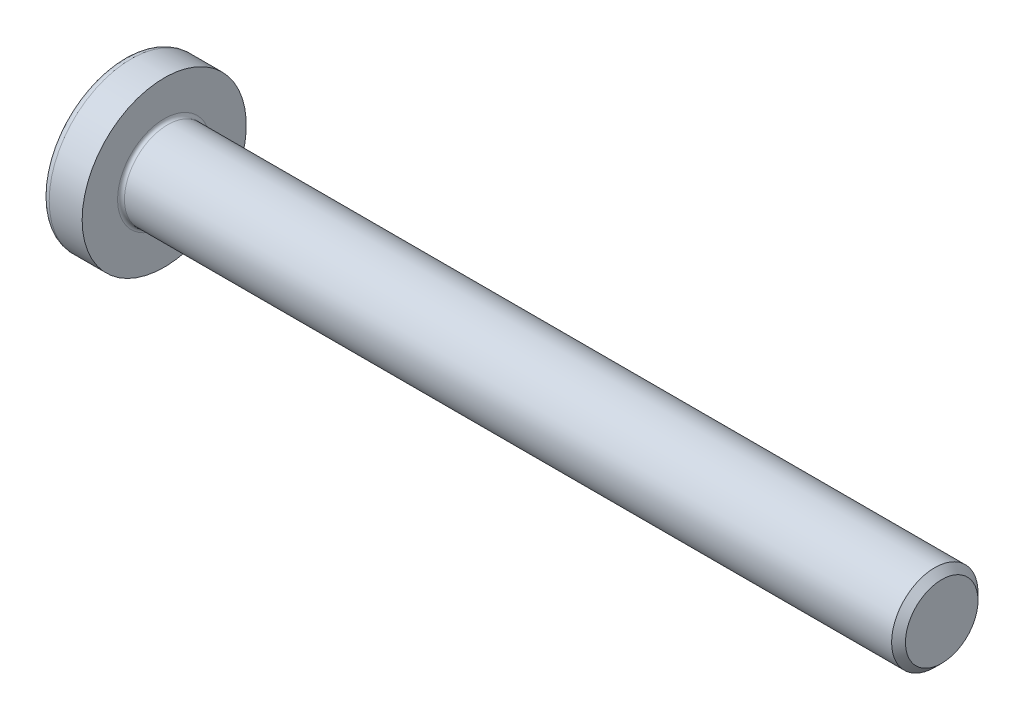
ISO-10303-21;
HEADER;
FILE_DESCRIPTION(('STEP AP214'),'2;1');
FILE_NAME('part.step','',(''),(''),'','','');
FILE_SCHEMA(('AUTOMOTIVE_DESIGN { 1 0 10303 214 1 1 1 1 }'));
ENDSEC;
DATA;
#1=APPLICATION_CONTEXT('core data for automotive mechanical design processes');
#2=APPLICATION_PROTOCOL_DEFINITION('international standard','automotive_design',2000,#1);
#3=PRODUCT_CONTEXT('',#1,'mechanical');
#4=PRODUCT('Part','Part','',(#3));
#5=PRODUCT_RELATED_PRODUCT_CATEGORY('part','',(#4));
#6=PRODUCT_DEFINITION_FORMATION('','',#4);
#7=PRODUCT_DEFINITION_CONTEXT('part definition',#1,'design');
#8=PRODUCT_DEFINITION('design','',#6,#7);
#9=PRODUCT_DEFINITION_SHAPE('','',#8);
#10=(LENGTH_UNIT() NAMED_UNIT(*) SI_UNIT(.MILLI.,.METRE.));
#11=(NAMED_UNIT(*) PLANE_ANGLE_UNIT() SI_UNIT($,.RADIAN.));
#12=(NAMED_UNIT(*) SI_UNIT($,.STERADIAN.) SOLID_ANGLE_UNIT());
#13=UNCERTAINTY_MEASURE_WITH_UNIT(LENGTH_MEASURE(1.E-05),#10,'distance_accuracy_value','');
#14=(GEOMETRIC_REPRESENTATION_CONTEXT(3) GLOBAL_UNCERTAINTY_ASSIGNED_CONTEXT((#13)) GLOBAL_UNIT_ASSIGNED_CONTEXT((#10,
#11,#12)) REPRESENTATION_CONTEXT('',''));
#15=CARTESIAN_POINT('',(0.,0.,0.));
#16=DIRECTION('',(0.,0.,1.));
#17=DIRECTION('',(1.,0.,0.));
#18=AXIS2_PLACEMENT_3D('',#15,#16,#17);
#19=CARTESIAN_POINT('',(8.,0.,0.));
#20=DIRECTION('',(-1.,0.,0.));
#21=DIRECTION('',(0.,1.,0.));
#22=AXIS2_PLACEMENT_3D('',#19,#20,#21);
#23=SPHERICAL_SURFACE('',#22,8.);
#24=CARTESIAN_POINT('',(1.42427123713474,0.,0.));
#25=DIRECTION('',(-1.,0.,0.));
#26=DIRECTION('',(0.,0.,1.));
#27=AXIS2_PLACEMENT_3D('',#24,#25,#26);
#28=CIRCLE('',#27,4.55629139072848);
#29=CARTESIAN_POINT('',(1.42427123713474,0.,4.55629139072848));
#30=VERTEX_POINT('',#29);
#31=EDGE_CURVE('E372',#30,#30,#28,.T.);
#32=ORIENTED_EDGE('',*,*,#31,.T.);
#33=EDGE_LOOP('',(#32));
#34=FACE_BOUND('',#33,.T.);
#35=CARTESIAN_POINT('',(0.0676093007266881,0.,0.));
#36=DIRECTION('',(1.,0.,0.));
#37=DIRECTION('',(0.,0.,-1.));
#38=AXIS2_PLACEMENT_3D('',#35,#36,#37);
#39=CIRCLE('',#38,1.03787176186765);
#40=CARTESIAN_POINT('',(0.067609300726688,-0.514999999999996,-0.901084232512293));
#41=VERTEX_POINT('',#40);
#42=CARTESIAN_POINT('',(0.0676093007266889,-0.901084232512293,-0.515));
#43=VERTEX_POINT('',#42);
#44=EDGE_CURVE('E415',#41,#43,#39,.F.);
#45=ORIENTED_EDGE('',*,*,#44,.F.);
#46=CARTESIAN_POINT('',(8.,-0.515,0.));
#47=DIRECTION('',(0.,1.,0.));
#48=DIRECTION('',(0.,0.,1.));
#49=AXIS2_PLACEMENT_3D('',#46,#47,#48);
#50=CIRCLE('',#49,7.98340622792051);
#51=CARTESIAN_POINT('',(0.322606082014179,-0.514999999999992,-2.18915454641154));
#52=VERTEX_POINT('',#51);
#53=EDGE_CURVE('E364',#52,#41,#50,.T.);
#54=ORIENTED_EDGE('',*,*,#53,.F.);
#55=CARTESIAN_POINT('',(7.34565688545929,0.,1.31240929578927));
#56=DIRECTION('',(0.446197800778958,0.,-0.89493436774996));
#57=DIRECTION('',(-0.89493436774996,0.,-0.446197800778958));
#58=AXIS2_PLACEMENT_3D('',#55,#56,#57);
#59=CIRCLE('',#58,7.86444002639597);
#60=CARTESIAN_POINT('',(0.322606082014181,0.515000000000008,-2.18915454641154));
#61=VERTEX_POINT('',#60);
#62=EDGE_CURVE('E238',#52,#61,#59,.T.);
#63=ORIENTED_EDGE('',*,*,#62,.T.);
#64=CARTESIAN_POINT('',(8.,0.515,0.));
#65=DIRECTION('',(0.,-1.,0.));
#66=DIRECTION('',(0.,0.,-1.));
#67=AXIS2_PLACEMENT_3D('',#64,#65,#66);
#68=CIRCLE('',#67,7.98340622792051);
#69=CARTESIAN_POINT('',(0.0676093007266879,0.515000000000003,-0.901084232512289));
#70=VERTEX_POINT('',#69);
#71=EDGE_CURVE('E368',#70,#61,#68,.T.);
#72=ORIENTED_EDGE('',*,*,#71,.F.);
#73=CARTESIAN_POINT('',(0.0676093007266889,0.901084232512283,-0.515));
#74=VERTEX_POINT('',#73);
#75=EDGE_CURVE('E439',#74,#70,#39,.F.);
#76=ORIENTED_EDGE('',*,*,#75,.F.);
#77=CARTESIAN_POINT('',(8.,0.,-0.515));
#78=DIRECTION('',(0.,0.,1.));
#79=DIRECTION('',(1.,0.,0.));
#80=AXIS2_PLACEMENT_3D('',#77,#78,#79);
#81=CIRCLE('',#80,7.98340622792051);
#82=CARTESIAN_POINT('',(0.32260608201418,2.18915454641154,-0.515));
#83=VERTEX_POINT('',#82);
#84=EDGE_CURVE('E232',#83,#74,#81,.T.);
#85=ORIENTED_EDGE('',*,*,#84,.F.);
#86=CARTESIAN_POINT('',(7.34565688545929,-1.31240929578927,0.));
#87=DIRECTION('',(0.446197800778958,0.89493436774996,0.));
#88=DIRECTION('',(-0.89493436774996,0.446197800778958,0.));
#89=AXIS2_PLACEMENT_3D('',#86,#87,#88);
#90=CIRCLE('',#89,7.86444002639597);
#91=CARTESIAN_POINT('',(0.322606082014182,2.18915454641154,0.514999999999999));
#92=VERTEX_POINT('',#91);
#93=EDGE_CURVE('E235',#83,#92,#90,.T.);
#94=ORIENTED_EDGE('',*,*,#93,.T.);
#95=CARTESIAN_POINT('',(8.,0.,0.515));
#96=DIRECTION('',(0.,0.,-1.));
#97=DIRECTION('',(0.,1.,0.));
#98=AXIS2_PLACEMENT_3D('',#95,#96,#97);
#99=CIRCLE('',#98,7.98340622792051);
#100=CARTESIAN_POINT('',(0.0676093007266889,0.901084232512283,0.515));
#101=VERTEX_POINT('',#100);
#102=EDGE_CURVE('E228',#101,#92,#99,.T.);
#103=ORIENTED_EDGE('',*,*,#102,.F.);
#104=CARTESIAN_POINT('',(0.067609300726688,0.514999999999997,0.901084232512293));
#105=VERTEX_POINT('',#104);
#106=EDGE_CURVE('E436',#105,#101,#39,.F.);
#107=ORIENTED_EDGE('',*,*,#106,.F.);
#108=CARTESIAN_POINT('',(0.322606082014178,0.514999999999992,2.18915454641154));
#109=VERTEX_POINT('',#108);
#110=EDGE_CURVE('E365',#109,#105,#68,.T.);
#111=ORIENTED_EDGE('',*,*,#110,.F.);
#112=CARTESIAN_POINT('',(7.34565688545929,0.,-1.31240929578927));
#113=DIRECTION('',(0.446197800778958,0.,0.89493436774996));
#114=DIRECTION('',(0.89493436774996,0.,-0.446197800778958));
#115=AXIS2_PLACEMENT_3D('',#112,#113,#114);
#116=CIRCLE('',#115,7.86444002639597);
#117=CARTESIAN_POINT('',(0.32260608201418,-0.515000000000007,2.18915454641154));
#118=VERTEX_POINT('',#117);
#119=EDGE_CURVE('E241',#109,#118,#116,.T.);
#120=ORIENTED_EDGE('',*,*,#119,.T.);
#121=CARTESIAN_POINT('',(0.0676093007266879,-0.515000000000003,0.901084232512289));
#122=VERTEX_POINT('',#121);
#123=EDGE_CURVE('E362',#122,#118,#50,.T.);
#124=ORIENTED_EDGE('',*,*,#123,.F.);
#125=CARTESIAN_POINT('',(0.0676093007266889,-0.901084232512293,0.514999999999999));
#126=VERTEX_POINT('',#125);
#127=EDGE_CURVE('E298',#126,#122,#39,.F.);
#128=ORIENTED_EDGE('',*,*,#127,.F.);
#129=CARTESIAN_POINT('',(0.322606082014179,-2.18915454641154,0.514999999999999));
#130=VERTEX_POINT('',#129);
#131=EDGE_CURVE('E229',#130,#126,#99,.T.);
#132=ORIENTED_EDGE('',*,*,#131,.F.);
#133=CARTESIAN_POINT('',(7.34565688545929,1.31240929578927,0.));
#134=DIRECTION('',(0.446197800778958,-0.89493436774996,0.));
#135=DIRECTION('',(0.89493436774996,0.446197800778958,0.));
#136=AXIS2_PLACEMENT_3D('',#133,#134,#135);
#137=CIRCLE('',#136,7.86444002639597);
#138=CARTESIAN_POINT('',(0.322606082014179,-2.18915454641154,-0.515));
#139=VERTEX_POINT('',#138);
#140=EDGE_CURVE('E219',#130,#139,#137,.T.);
#141=ORIENTED_EDGE('',*,*,#140,.T.);
#142=EDGE_CURVE('E58',#43,#139,#81,.T.);
#143=ORIENTED_EDGE('',*,*,#142,.F.);
#144=EDGE_LOOP('',(#45,#54,#63,#72,#76,#85,#94,#103,#107,#111,#120,#124,#128,#132,#141,#143));
#145=FACE_BOUND('',#144,.T.);
#146=ADVANCED_FACE('F35',(#34,#145),#23,.T.);
#147=CARTESIAN_POINT('',(0.,2.35,-0.515));
#148=DIRECTION('',(0.,0.,1.));
#149=DIRECTION('',(1.,0.,0.));
#150=AXIS2_PLACEMENT_3D('',#147,#148,#149);
#151=PLANE('',#150);
#152=ORIENTED_EDGE('',*,*,#84,.T.);
#153=CARTESIAN_POINT('',(-1.51390484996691,1.02651837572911,-0.515));
#154=CARTESIAN_POINT('',(-1.19828075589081,1.00181934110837,-0.515));
#155=CARTESIAN_POINT('',(-0.882669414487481,0.976954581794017,-0.515));
#156=CARTESIAN_POINT('',(-0.251463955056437,0.926774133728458,-0.515));
#157=CARTESIAN_POINT('',(0.0641301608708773,0.901458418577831,-0.515));
#158=CARTESIAN_POINT('',(0.537487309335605,0.863059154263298,-0.515));
#159=CARTESIAN_POINT('',(0.695267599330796,0.850188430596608,-0.515));
#160=CARTESIAN_POINT('',(1.01081295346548,0.824283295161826,-0.515));
#161=CARTESIAN_POINT('',(1.16857801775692,0.811248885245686,-0.515));
#162=CARTESIAN_POINT('',(1.48408237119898,0.784992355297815,-0.515));
#163=CARTESIAN_POINT('',(1.64182166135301,0.771770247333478,-0.515));
#164=CARTESIAN_POINT('',(1.95728793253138,0.7451057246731,-0.515));
#165=CARTESIAN_POINT('',(2.11501491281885,0.731663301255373,-0.515));
#166=CARTESIAN_POINT('',(2.48551875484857,0.699781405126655,-0.515));
#167=CARTESIAN_POINT('',(2.69828652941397,0.681236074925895,-0.515));
#168=CARTESIAN_POINT('',(3.12376344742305,0.643549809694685,-0.515));
#169=CARTESIAN_POINT('',(3.33647259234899,0.624408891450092,-0.515));
#170=CARTESIAN_POINT('',(3.76177021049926,0.585350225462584,-0.515));
#171=CARTESIAN_POINT('',(3.97435870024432,0.565432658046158,-0.515));
#172=CARTESIAN_POINT('',(4.39945864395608,0.524537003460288,-0.515));
#173=CARTESIAN_POINT('',(4.61197008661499,0.503558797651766,-0.515));
#174=CARTESIAN_POINT('',(4.93071637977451,0.470931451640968,-0.515));
#175=CARTESIAN_POINT('',(5.03701000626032,0.459857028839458,-0.515));
#176=CARTESIAN_POINT('',(5.24954252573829,0.437229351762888,-0.515));
#177=CARTESIAN_POINT('',(5.35578142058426,0.425676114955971,-0.515));
#178=CARTESIAN_POINT('',(5.56815317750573,0.401967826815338,-0.515));
#179=CARTESIAN_POINT('',(5.6742860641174,0.389812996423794,-0.515));
#180=CARTESIAN_POINT('',(5.88647145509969,0.364705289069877,-0.515));
#181=CARTESIAN_POINT('',(5.99252394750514,0.35175231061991,-0.515));
#182=CARTESIAN_POINT('',(6.20462993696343,0.324739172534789,-0.515));
#183=CARTESIAN_POINT('',(6.31068325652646,0.310677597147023,-0.515));
#184=CARTESIAN_POINT('',(6.46957142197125,0.288366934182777,-0.515));
#185=CARTESIAN_POINT('',(6.52249184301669,0.280728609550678,-0.515));
#186=CARTESIAN_POINT('',(6.62826069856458,0.2649303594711,-0.515));
#187=CARTESIAN_POINT('',(6.68110912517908,0.256770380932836,-0.515));
#188=CARTESIAN_POINT('',(6.78677752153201,0.239755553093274,-0.515));
#189=CARTESIAN_POINT('',(6.83959732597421,0.230899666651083,-0.515));
#190=CARTESIAN_POINT('',(6.94505554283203,0.212240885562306,-0.515));
#191=CARTESIAN_POINT('',(6.99769400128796,0.202438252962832,-0.515));
#192=CARTESIAN_POINT('',(7.10276751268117,0.181407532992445,-0.515));
#193=CARTESIAN_POINT('',(7.1552022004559,0.17017756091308,-0.515));
#194=CARTESIAN_POINT('',(7.23345080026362,0.151498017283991,-0.515));
#195=CARTESIAN_POINT('',(7.25947836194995,0.144962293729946,-0.515));
#196=CARTESIAN_POINT('',(7.31128722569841,0.130937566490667,-0.515));
#197=CARTESIAN_POINT('',(7.33706839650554,0.123448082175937,-0.515));
#198=CARTESIAN_POINT('',(7.36266137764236,0.115313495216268,-0.515));
#199=B_SPLINE_CURVE_WITH_KNOTS('',3,(#153,#154,#155,#156,#157,#158,#159,#160,#161,#162,#163,
#164,#165,#166,#167,#168,#169,#170,#171,#172,#173,#174,#175,#176,#177,#178,#179,#180,#181,#182,
#183,#184,#185,#186,#187,#188,#189,#190,#191,#192,#193,#194,#195,#196,#197,#198),.UNSPECIFIED.,
.F.,.F.,(4,2,2,2,2,2,2,2,2,2,2,2,2,2,2,2,2,2,2,2,2,2,4),(0.,0.949767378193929,1.89959054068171,
2.37450359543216,2.84941128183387,3.32428857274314,3.79918470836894,4.43990748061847,
5.08061221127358,5.72116905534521,6.36179770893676,6.68240380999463,7.0029982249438,
7.32347575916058,7.64399412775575,7.96492866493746,8.12533319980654,8.28575408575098,
8.44641876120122,8.60703909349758,8.76787376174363,8.84836551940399,8.92889800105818),.UNSPECIFIED.);
#200=CARTESIAN_POINT('',(2.74,0.677477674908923,-0.515));
#201=VERTEX_POINT('',#200);
#202=EDGE_CURVE('E276',#74,#201,#199,.T.);
#203=ORIENTED_EDGE('',*,*,#202,.T.);
#204=DIRECTION('',(0.,1.,0.));
#205=VECTOR('',#204,1.);
#206=CARTESIAN_POINT('',(2.74,-0.983886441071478,-0.515));
#207=LINE('',#206,#205);
#208=CARTESIAN_POINT('',(2.74,0.983886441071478,-0.515));
#209=VERTEX_POINT('',#208);
#210=EDGE_CURVE('E393',#201,#209,#207,.T.);
#211=ORIENTED_EDGE('',*,*,#210,.T.);
#212=DIRECTION('',(0.89493436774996,-0.446197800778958,0.));
#213=VECTOR('',#212,1.);
#214=CARTESIAN_POINT('',(0.,2.35,-0.515));
#215=LINE('',#214,#213);
#216=EDGE_CURVE('E369',#83,#209,#215,.T.);
#217=ORIENTED_EDGE('',*,*,#216,.F.);
#218=EDGE_LOOP('',(#152,#203,#211,#217));
#219=FACE_BOUND('',#218,.T.);
#220=ADVANCED_FACE('F167',(#219),#151,.T.);
#221=CARTESIAN_POINT('',(2.74,-0.983886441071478,-0.515));
#222=VERTEX_POINT('',#221);
#223=CARTESIAN_POINT('',(2.74,-0.677477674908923,-0.515));
#224=VERTEX_POINT('',#223);
#225=EDGE_CURVE('E390',#222,#224,#207,.T.);
#226=ORIENTED_EDGE('',*,*,#225,.T.);
#227=CARTESIAN_POINT('',(-1.51390484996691,-1.02651837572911,-0.515));
#228=CARTESIAN_POINT('',(-1.19828075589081,-1.00181934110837,-0.515));
#229=CARTESIAN_POINT('',(-0.882669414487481,-0.976954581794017,-0.515));
#230=CARTESIAN_POINT('',(-0.251463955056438,-0.926774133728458,-0.515));
#231=CARTESIAN_POINT('',(0.0641301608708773,-0.901458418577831,-0.515));
#232=CARTESIAN_POINT('',(0.537487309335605,-0.863059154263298,-0.515));
#233=CARTESIAN_POINT('',(0.695267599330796,-0.850188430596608,-0.515));
#234=CARTESIAN_POINT('',(1.01081295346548,-0.824283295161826,-0.515));
#235=CARTESIAN_POINT('',(1.16857801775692,-0.811248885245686,-0.515));
#236=CARTESIAN_POINT('',(1.48408237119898,-0.784992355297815,-0.515));
#237=CARTESIAN_POINT('',(1.64182166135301,-0.771770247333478,-0.515));
#238=CARTESIAN_POINT('',(1.95728793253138,-0.7451057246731,-0.515));
#239=CARTESIAN_POINT('',(2.11501491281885,-0.731663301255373,-0.515));
#240=CARTESIAN_POINT('',(2.48551875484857,-0.699781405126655,-0.515));
#241=CARTESIAN_POINT('',(2.69828652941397,-0.681236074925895,-0.515));
#242=CARTESIAN_POINT('',(3.12376344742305,-0.643549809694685,-0.515));
#243=CARTESIAN_POINT('',(3.33647259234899,-0.624408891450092,-0.515));
#244=CARTESIAN_POINT('',(3.76177021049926,-0.585350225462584,-0.515));
#245=CARTESIAN_POINT('',(3.97435870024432,-0.565432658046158,-0.515));
#246=CARTESIAN_POINT('',(4.39945864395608,-0.524537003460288,-0.515));
#247=CARTESIAN_POINT('',(4.61197008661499,-0.503558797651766,-0.515));
#248=CARTESIAN_POINT('',(4.93071637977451,-0.470931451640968,-0.515));
#249=CARTESIAN_POINT('',(5.03701000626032,-0.459857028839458,-0.515));
#250=CARTESIAN_POINT('',(5.24954252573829,-0.437229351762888,-0.515));
#251=CARTESIAN_POINT('',(5.35578142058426,-0.425676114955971,-0.515));
#252=CARTESIAN_POINT('',(5.56815317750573,-0.401967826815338,-0.515));
#253=CARTESIAN_POINT('',(5.6742860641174,-0.389812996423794,-0.515));
#254=CARTESIAN_POINT('',(5.88647145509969,-0.364705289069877,-0.515));
#255=CARTESIAN_POINT('',(5.99252394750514,-0.35175231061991,-0.515));
#256=CARTESIAN_POINT('',(6.20462993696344,-0.324739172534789,-0.515));
#257=CARTESIAN_POINT('',(6.31068325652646,-0.310677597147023,-0.515));
#258=CARTESIAN_POINT('',(6.46957142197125,-0.288366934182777,-0.515));
#259=CARTESIAN_POINT('',(6.52249184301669,-0.280728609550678,-0.515));
#260=CARTESIAN_POINT('',(6.62826069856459,-0.2649303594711,-0.515));
#261=CARTESIAN_POINT('',(6.68110912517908,-0.256770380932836,-0.515));
#262=CARTESIAN_POINT('',(6.78677752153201,-0.239755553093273,-0.515));
#263=CARTESIAN_POINT('',(6.83959732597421,-0.230899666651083,-0.515));
#264=CARTESIAN_POINT('',(6.94505554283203,-0.212240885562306,-0.515));
#265=CARTESIAN_POINT('',(6.99769400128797,-0.202438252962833,-0.515));
#266=CARTESIAN_POINT('',(7.10276751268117,-0.181407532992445,-0.515));
#267=CARTESIAN_POINT('',(7.1552022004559,-0.170177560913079,-0.515));
#268=CARTESIAN_POINT('',(7.23345080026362,-0.15149801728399,-0.515));
#269=CARTESIAN_POINT('',(7.25947836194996,-0.144962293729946,-0.515));
#270=CARTESIAN_POINT('',(7.31128722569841,-0.130937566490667,-0.515));
#271=CARTESIAN_POINT('',(7.33706839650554,-0.123448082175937,-0.515));
#272=CARTESIAN_POINT('',(7.36266137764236,-0.115313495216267,-0.515));
#273=B_SPLINE_CURVE_WITH_KNOTS('',3,(#227,#228,#229,#230,#231,#232,#233,#234,#235,#236,#237,
#238,#239,#240,#241,#242,#243,#244,#245,#246,#247,#248,#249,#250,#251,#252,#253,#254,#255,#256,
#257,#258,#259,#260,#261,#262,#263,#264,#265,#266,#267,#268,#269,#270,#271,#272),.UNSPECIFIED.,
.F.,.F.,(4,2,2,2,2,2,2,2,2,2,2,2,2,2,2,2,2,2,2,2,2,2,4),(0.,0.949767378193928,1.89959054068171,
2.37450359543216,2.84941128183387,3.32428857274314,3.79918470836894,4.43990748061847,
5.08061221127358,5.72116905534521,6.36179770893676,6.68240380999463,7.0029982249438,
7.32347575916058,7.64399412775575,7.96492866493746,8.12533319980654,8.28575408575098,
8.44641876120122,8.60703909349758,8.76787376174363,8.84836551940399,8.92889800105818),.UNSPECIFIED.);
#274=EDGE_CURVE('E263',#224,#43,#273,.F.);
#275=ORIENTED_EDGE('',*,*,#274,.T.);
#276=ORIENTED_EDGE('',*,*,#142,.T.);
#277=DIRECTION('',(0.89493436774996,0.446197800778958,0.));
#278=VECTOR('',#277,1.);
#279=CARTESIAN_POINT('',(0.,-2.35,-0.515));
#280=LINE('',#279,#278);
#281=EDGE_CURVE('E375',#139,#222,#280,.T.);
#282=ORIENTED_EDGE('',*,*,#281,.T.);
#283=EDGE_LOOP('',(#226,#275,#276,#282));
#284=FACE_BOUND('',#283,.T.);
#285=ADVANCED_FACE('F173',(#284),#151,.T.);
#286=CARTESIAN_POINT('',(0.,-2.35,0.514999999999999));
#287=DIRECTION('',(0.,0.,-1.));
#288=DIRECTION('',(0.,1.,0.));
#289=AXIS2_PLACEMENT_3D('',#286,#287,#288);
#290=PLANE('',#289);
#291=DIRECTION('',(0.,-1.,0.));
#292=VECTOR('',#291,1.);
#293=CARTESIAN_POINT('',(2.74,0.983886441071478,0.515));
#294=LINE('',#293,#292);
#295=CARTESIAN_POINT('',(2.74,0.983886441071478,0.515));
#296=VERTEX_POINT('',#295);
#297=CARTESIAN_POINT('',(2.74,0.677477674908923,0.515));
#298=VERTEX_POINT('',#297);
#299=EDGE_CURVE('E383',#296,#298,#294,.T.);
#300=ORIENTED_EDGE('',*,*,#299,.T.);
#301=CARTESIAN_POINT('',(-1.51390485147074,1.02651837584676,0.514999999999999));
#302=CARTESIAN_POINT('',(-1.19828075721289,1.00181934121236,0.514999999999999));
#303=CARTESIAN_POINT('',(-0.882669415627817,0.976954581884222,0.514999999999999));
#304=CARTESIAN_POINT('',(-0.251463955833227,0.926774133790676,0.515));
#305=CARTESIAN_POINT('',(0.0641301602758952,0.901458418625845,0.515));
#306=CARTESIAN_POINT('',(0.537487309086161,0.863059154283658,0.515));
#307=CARTESIAN_POINT('',(0.695267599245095,0.85018843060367,0.515));
#308=CARTESIAN_POINT('',(1.01081295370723,0.824283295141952,0.515));
#309=CARTESIAN_POINT('',(1.16857801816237,0.811248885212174,0.515));
#310=CARTESIAN_POINT('',(1.48408237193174,0.784992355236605,0.515));
#311=CARTESIAN_POINT('',(1.64182166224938,0.771770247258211,0.515));
#312=CARTESIAN_POINT('',(1.95728793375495,0.745105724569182,0.515));
#313=CARTESIAN_POINT('',(2.11501491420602,0.731663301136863,0.515));
#314=CARTESIAN_POINT('',(2.48551875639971,0.699781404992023,0.515));
#315=CARTESIAN_POINT('',(2.6982865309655,0.681236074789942,0.515));
#316=CARTESIAN_POINT('',(3.12376344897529,0.643549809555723,0.515));
#317=CARTESIAN_POINT('',(3.33647259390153,0.624408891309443,0.515));
#318=CARTESIAN_POINT('',(3.76177021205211,0.585350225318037,0.515));
#319=CARTESIAN_POINT('',(3.97435870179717,0.565432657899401,0.515));
#320=CARTESIAN_POINT('',(4.39945864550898,0.524537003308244,0.515));
#321=CARTESIAN_POINT('',(4.61197008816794,0.503558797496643,0.515));
#322=CARTESIAN_POINT('',(4.9307163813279,0.470931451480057,0.515));
#323=CARTESIAN_POINT('',(5.03701000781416,0.459857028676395,0.515));
#324=CARTESIAN_POINT('',(5.24954252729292,0.437229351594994,0.515));
#325=CARTESIAN_POINT('',(5.35578142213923,0.4256761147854,0.515));
#326=CARTESIAN_POINT('',(5.56815317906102,0.401967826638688,0.515));
#327=CARTESIAN_POINT('',(5.67428606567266,0.389812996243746,0.515));
#328=CARTESIAN_POINT('',(5.88647145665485,0.36470528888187,0.515));
#329=CARTESIAN_POINT('',(5.99252394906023,0.351752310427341,0.515));
#330=CARTESIAN_POINT('',(6.204629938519,0.324739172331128,0.515));
#331=CARTESIAN_POINT('',(6.31068325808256,0.31067759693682,0.515));
#332=CARTESIAN_POINT('',(6.46957142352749,0.288366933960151,0.515));
#333=CARTESIAN_POINT('',(6.52249184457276,0.280728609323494,0.515));
#334=CARTESIAN_POINT('',(6.62826070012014,0.26493035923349,0.515));
#335=CARTESIAN_POINT('',(6.68110912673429,0.256770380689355,0.515));
#336=CARTESIAN_POINT('',(6.7867775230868,0.239755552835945,0.515));
#337=CARTESIAN_POINT('',(6.83959732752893,0.230899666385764,0.515));
#338=CARTESIAN_POINT('',(6.94505554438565,0.212240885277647,0.515));
#339=CARTESIAN_POINT('',(6.99769400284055,0.202438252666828,0.515));
#340=CARTESIAN_POINT('',(7.10276751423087,0.181407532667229,0.515));
#341=CARTESIAN_POINT('',(7.15520220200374,0.170177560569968,0.515));
#342=CARTESIAN_POINT('',(7.23345080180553,0.151498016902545,0.515));
#343=CARTESIAN_POINT('',(7.25947836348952,0.144962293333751,0.515));
#344=CARTESIAN_POINT('',(7.31128722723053,0.130937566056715,0.515));
#345=CARTESIAN_POINT('',(7.33706839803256,0.123448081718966,0.515));
#346=CARTESIAN_POINT('',(7.36266137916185,0.115313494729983,0.515));
#347=B_SPLINE_CURVE_WITH_KNOTS('',3,(#301,#302,#303,#304,#305,#306,#307,#308,#309,#310,#311,
#312,#313,#314,#315,#316,#317,#318,#319,#320,#321,#322,#323,#324,#325,#326,#327,#328,#329,#330,
#331,#332,#333,#334,#335,#336,#337,#338,#339,#340,#341,#342,#343,#344,#345,#346),.UNSPECIFIED.,
.F.,.F.,(4,2,2,2,2,2,2,2,2,2,2,2,2,2,2,2,2,2,2,2,2,2,4),(0.,0.949767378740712,1.89959054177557,
2.37450359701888,2.8494112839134,3.32428857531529,3.79918471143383,4.43990748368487,
5.08061221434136,5.7211690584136,6.36179771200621,6.68240381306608,7.00299822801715,
7.32347576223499,7.6439941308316,7.96492866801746,8.12533320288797,8.28575408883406,
8.44641876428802,8.6070390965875,8.76787376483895,8.84836552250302,8.92889800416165),.UNSPECIFIED.);
#348=EDGE_CURVE('E287',#298,#101,#347,.F.);
#349=ORIENTED_EDGE('',*,*,#348,.T.);
#350=ORIENTED_EDGE('',*,*,#102,.T.);
#351=DIRECTION('',(0.89493436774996,-0.446197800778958,0.));
#352=VECTOR('',#351,1.);
#353=CARTESIAN_POINT('',(0.,2.35,0.515));
#354=LINE('',#353,#352);
#355=EDGE_CURVE('E373',#92,#296,#354,.T.);
#356=ORIENTED_EDGE('',*,*,#355,.T.);
#357=EDGE_LOOP('',(#300,#349,#350,#356));
#358=FACE_BOUND('',#357,.T.);
#359=ADVANCED_FACE('F308',(#358),#290,.T.);
#360=ORIENTED_EDGE('',*,*,#131,.T.);
#361=CARTESIAN_POINT('',(-1.51390485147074,-1.02651837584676,0.514999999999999));
#362=CARTESIAN_POINT('',(-1.19828075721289,-1.00181934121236,0.514999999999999));
#363=CARTESIAN_POINT('',(-0.882669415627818,-0.976954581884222,0.514999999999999));
#364=CARTESIAN_POINT('',(-0.251463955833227,-0.926774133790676,0.514999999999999));
#365=CARTESIAN_POINT('',(0.0641301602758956,-0.901458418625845,0.514999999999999));
#366=CARTESIAN_POINT('',(0.537487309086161,-0.863059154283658,0.514999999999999));
#367=CARTESIAN_POINT('',(0.695267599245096,-0.850188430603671,0.514999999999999));
#368=CARTESIAN_POINT('',(1.01081295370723,-0.824283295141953,0.514999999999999));
#369=CARTESIAN_POINT('',(1.16857801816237,-0.811248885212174,0.514999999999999));
#370=CARTESIAN_POINT('',(1.48408237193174,-0.784992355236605,0.514999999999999));
#371=CARTESIAN_POINT('',(1.64182166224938,-0.771770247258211,0.514999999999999));
#372=CARTESIAN_POINT('',(1.95728793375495,-0.745105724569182,0.514999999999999));
#373=CARTESIAN_POINT('',(2.11501491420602,-0.731663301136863,0.515));
#374=CARTESIAN_POINT('',(2.48551875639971,-0.699781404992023,0.515));
#375=CARTESIAN_POINT('',(2.6982865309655,-0.681236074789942,0.515));
#376=CARTESIAN_POINT('',(3.12376344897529,-0.643549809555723,0.515));
#377=CARTESIAN_POINT('',(3.33647259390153,-0.624408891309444,0.515));
#378=CARTESIAN_POINT('',(3.76177021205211,-0.585350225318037,0.515));
#379=CARTESIAN_POINT('',(3.97435870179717,-0.565432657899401,0.515));
#380=CARTESIAN_POINT('',(4.39945864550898,-0.524537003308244,0.515));
#381=CARTESIAN_POINT('',(4.61197008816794,-0.503558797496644,0.515));
#382=CARTESIAN_POINT('',(4.9307163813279,-0.470931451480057,0.515));
#383=CARTESIAN_POINT('',(5.03701000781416,-0.459857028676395,0.515));
#384=CARTESIAN_POINT('',(5.24954252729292,-0.437229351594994,0.515));
#385=CARTESIAN_POINT('',(5.35578142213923,-0.4256761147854,0.515));
#386=CARTESIAN_POINT('',(5.56815317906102,-0.401967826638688,0.515));
#387=CARTESIAN_POINT('',(5.67428606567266,-0.389812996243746,0.515));
#388=CARTESIAN_POINT('',(5.88647145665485,-0.36470528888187,0.515));
#389=CARTESIAN_POINT('',(5.99252394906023,-0.351752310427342,0.515));
#390=CARTESIAN_POINT('',(6.20462993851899,-0.324739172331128,0.515));
#391=CARTESIAN_POINT('',(6.31068325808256,-0.31067759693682,0.515));
#392=CARTESIAN_POINT('',(6.46957142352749,-0.288366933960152,0.515));
#393=CARTESIAN_POINT('',(6.52249184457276,-0.280728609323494,0.515));
#394=CARTESIAN_POINT('',(6.62826070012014,-0.264930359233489,0.515));
#395=CARTESIAN_POINT('',(6.68110912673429,-0.256770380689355,0.515));
#396=CARTESIAN_POINT('',(6.7867775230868,-0.239755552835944,0.515));
#397=CARTESIAN_POINT('',(6.83959732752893,-0.230899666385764,0.515));
#398=CARTESIAN_POINT('',(6.94505554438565,-0.212240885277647,0.515));
#399=CARTESIAN_POINT('',(6.99769400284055,-0.202438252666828,0.515));
#400=CARTESIAN_POINT('',(7.10276751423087,-0.181407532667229,0.515));
#401=CARTESIAN_POINT('',(7.15520220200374,-0.170177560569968,0.515));
#402=CARTESIAN_POINT('',(7.23345080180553,-0.151498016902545,0.515));
#403=CARTESIAN_POINT('',(7.25947836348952,-0.144962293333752,0.515));
#404=CARTESIAN_POINT('',(7.31128722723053,-0.130937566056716,0.515));
#405=CARTESIAN_POINT('',(7.33706839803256,-0.123448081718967,0.515));
#406=CARTESIAN_POINT('',(7.36266137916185,-0.115313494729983,0.515));
#407=B_SPLINE_CURVE_WITH_KNOTS('',3,(#361,#362,#363,#364,#365,#366,#367,#368,#369,#370,#371,
#372,#373,#374,#375,#376,#377,#378,#379,#380,#381,#382,#383,#384,#385,#386,#387,#388,#389,#390,
#391,#392,#393,#394,#395,#396,#397,#398,#399,#400,#401,#402,#403,#404,#405,#406),.UNSPECIFIED.,
.F.,.F.,(4,2,2,2,2,2,2,2,2,2,2,2,2,2,2,2,2,2,2,2,2,2,4),(0.,0.949767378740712,1.89959054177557,
2.37450359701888,2.8494112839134,3.32428857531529,3.79918471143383,4.43990748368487,
5.08061221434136,5.7211690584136,6.36179771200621,6.68240381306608,7.00299822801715,
7.32347576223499,7.6439941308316,7.96492866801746,8.12533320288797,8.28575408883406,
8.44641876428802,8.6070390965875,8.76787376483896,8.84836552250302,8.92889800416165),.UNSPECIFIED.);
#408=CARTESIAN_POINT('',(2.74,-0.677477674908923,0.515));
#409=VERTEX_POINT('',#408);
#410=EDGE_CURVE('E299',#126,#409,#407,.T.);
#411=ORIENTED_EDGE('',*,*,#410,.T.);
#412=CARTESIAN_POINT('',(2.74,-0.983886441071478,0.515));
#413=VERTEX_POINT('',#412);
#414=EDGE_CURVE('E386',#409,#413,#294,.T.);
#415=ORIENTED_EDGE('',*,*,#414,.T.);
#416=DIRECTION('',(0.89493436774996,0.446197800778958,0.));
#417=VECTOR('',#416,1.);
#418=CARTESIAN_POINT('',(0.,-2.35,0.514999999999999));
#419=LINE('',#418,#417);
#420=EDGE_CURVE('E377',#130,#413,#419,.T.);
#421=ORIENTED_EDGE('',*,*,#420,.F.);
#422=EDGE_LOOP('',(#360,#411,#415,#421));
#423=FACE_BOUND('',#422,.T.);
#424=ADVANCED_FACE('F312',(#423),#290,.T.);
#425=CARTESIAN_POINT('',(2.74,-0.983886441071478,-0.515));
#426=DIRECTION('',(1.,0.,0.));
#427=DIRECTION('',(0.,0.,-1.));
#428=AXIS2_PLACEMENT_3D('',#425,#426,#427);
#429=PLANE('',#428);
#430=CARTESIAN_POINT('',(2.74,0.,0.));
#431=DIRECTION('',(-1.,0.,0.));
#432=DIRECTION('',(0.,0.,1.));
#433=AXIS2_PLACEMENT_3D('',#430,#431,#432);
#434=CIRCLE('',#433,0.851);
#435=EDGE_CURVE('E449',#224,#409,#434,.T.);
#436=ORIENTED_EDGE('',*,*,#435,.F.);
#437=ORIENTED_EDGE('',*,*,#225,.F.);
#438=DIRECTION('',(0.,0.,1.));
#439=VECTOR('',#438,1.);
#440=CARTESIAN_POINT('',(2.74,-0.983886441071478,-0.515));
#441=LINE('',#440,#439);
#442=EDGE_CURVE('E380',#222,#413,#441,.T.);
#443=ORIENTED_EDGE('',*,*,#442,.T.);
#444=ORIENTED_EDGE('',*,*,#414,.F.);
#445=EDGE_LOOP('',(#436,#437,#443,#444));
#446=FACE_BOUND('',#445,.T.);
#447=ADVANCED_FACE('F318',(#446),#429,.F.);
#448=CARTESIAN_POINT('',(2.74,-0.515000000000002,0.677477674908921));
#449=VERTEX_POINT('',#448);
#450=CARTESIAN_POINT('',(2.74,0.514999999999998,0.677477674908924));
#451=VERTEX_POINT('',#450);
#452=EDGE_CURVE('E427',#449,#451,#434,.T.);
#453=ORIENTED_EDGE('',*,*,#452,.F.);
#454=DIRECTION('',(0.,0.,-1.));
#455=VECTOR('',#454,1.);
#456=CARTESIAN_POINT('',(2.74,-0.515000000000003,0.983886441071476));
#457=LINE('',#456,#455);
#458=CARTESIAN_POINT('',(2.74,-0.515000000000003,0.983886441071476));
#459=VERTEX_POINT('',#458);
#460=EDGE_CURVE('E418',#459,#449,#457,.T.);
#461=ORIENTED_EDGE('',*,*,#460,.F.);
#462=DIRECTION('',(0.,1.,0.));
#463=VECTOR('',#462,1.);
#464=CARTESIAN_POINT('',(2.74,-0.515000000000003,0.983886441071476));
#465=LINE('',#464,#463);
#466=CARTESIAN_POINT('',(2.74,0.514999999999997,0.98388644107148));
#467=VERTEX_POINT('',#466);
#468=EDGE_CURVE('E356',#459,#467,#465,.T.);
#469=ORIENTED_EDGE('',*,*,#468,.T.);
#470=DIRECTION('',(0.,0.,1.));
#471=VECTOR('',#470,1.);
#472=CARTESIAN_POINT('',(2.74,0.515000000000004,-0.983886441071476));
#473=LINE('',#472,#471);
#474=EDGE_CURVE('E305',#451,#467,#473,.T.);
#475=ORIENTED_EDGE('',*,*,#474,.F.);
#476=EDGE_LOOP('',(#453,#461,#469,#475));
#477=FACE_BOUND('',#476,.T.);
#478=ADVANCED_FACE('F320',(#477),#429,.F.);
#479=EDGE_CURVE('E443',#298,#201,#434,.T.);
#480=ORIENTED_EDGE('',*,*,#479,.F.);
#481=ORIENTED_EDGE('',*,*,#299,.F.);
#482=DIRECTION('',(0.,0.,-1.));
#483=VECTOR('',#482,1.);
#484=CARTESIAN_POINT('',(2.74,0.983886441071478,0.515));
#485=LINE('',#484,#483);
#486=EDGE_CURVE('E387',#296,#209,#485,.T.);
#487=ORIENTED_EDGE('',*,*,#486,.T.);
#488=ORIENTED_EDGE('',*,*,#210,.F.);
#489=EDGE_LOOP('',(#480,#481,#487,#488));
#490=FACE_BOUND('',#489,.T.);
#491=ADVANCED_FACE('F327',(#490),#429,.F.);
#492=CARTESIAN_POINT('',(2.74,0.515000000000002,-0.677477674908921));
#493=VERTEX_POINT('',#492);
#494=CARTESIAN_POINT('',(2.74,-0.514999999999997,-0.677477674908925));
#495=VERTEX_POINT('',#494);
#496=EDGE_CURVE('E50',#493,#495,#434,.T.);
#497=ORIENTED_EDGE('',*,*,#496,.F.);
#498=CARTESIAN_POINT('',(2.74,0.515000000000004,-0.983886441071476));
#499=VERTEX_POINT('',#498);
#500=EDGE_CURVE('E344',#499,#493,#473,.T.);
#501=ORIENTED_EDGE('',*,*,#500,.F.);
#502=DIRECTION('',(0.,-1.,0.));
#503=VECTOR('',#502,1.);
#504=CARTESIAN_POINT('',(2.74,0.515000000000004,-0.983886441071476));
#505=LINE('',#504,#503);
#506=CARTESIAN_POINT('',(2.74,-0.514999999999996,-0.983886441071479));
#507=VERTEX_POINT('',#506);
#508=EDGE_CURVE('E408',#499,#507,#505,.T.);
#509=ORIENTED_EDGE('',*,*,#508,.T.);
#510=EDGE_CURVE('E345',#495,#507,#457,.T.);
#511=ORIENTED_EDGE('',*,*,#510,.F.);
#512=EDGE_LOOP('',(#497,#501,#509,#511));
#513=FACE_BOUND('',#512,.T.);
#514=ADVANCED_FACE('F322',(#513),#429,.F.);
#515=CARTESIAN_POINT('',(0.,-0.514999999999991,-2.35));
#516=DIRECTION('',(0.,1.,0.));
#517=DIRECTION('',(0.,0.,1.));
#518=AXIS2_PLACEMENT_3D('',#515,#516,#517);
#519=PLANE('',#518);
#520=ORIENTED_EDGE('',*,*,#460,.T.);
#521=CARTESIAN_POINT('',(-1.51390485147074,-0.515000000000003,1.02651837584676));
#522=CARTESIAN_POINT('',(-1.19828075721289,-0.515000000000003,1.00181934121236));
#523=CARTESIAN_POINT('',(-0.882669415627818,-0.515000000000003,0.97695458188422));
#524=CARTESIAN_POINT('',(-0.251463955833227,-0.515000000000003,0.926774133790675));
#525=CARTESIAN_POINT('',(0.0641301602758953,-0.515000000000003,0.901458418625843));
#526=CARTESIAN_POINT('',(0.537487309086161,-0.515000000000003,0.863059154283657));
#527=CARTESIAN_POINT('',(0.695267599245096,-0.515000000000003,0.850188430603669));
#528=CARTESIAN_POINT('',(1.01081295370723,-0.515000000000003,0.824283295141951));
#529=CARTESIAN_POINT('',(1.16857801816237,-0.515000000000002,0.811248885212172));
#530=CARTESIAN_POINT('',(1.48408237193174,-0.515000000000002,0.784992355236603));
#531=CARTESIAN_POINT('',(1.64182166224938,-0.515000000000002,0.771770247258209));
#532=CARTESIAN_POINT('',(1.95728793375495,-0.515000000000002,0.74510572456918));
#533=CARTESIAN_POINT('',(2.11501491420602,-0.515000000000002,0.731663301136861));
#534=CARTESIAN_POINT('',(2.48551875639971,-0.515000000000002,0.699781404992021));
#535=CARTESIAN_POINT('',(2.6982865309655,-0.515000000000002,0.68123607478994));
#536=CARTESIAN_POINT('',(3.12376344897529,-0.515000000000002,0.643549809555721));
#537=CARTESIAN_POINT('',(3.33647259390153,-0.515000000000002,0.624408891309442));
#538=CARTESIAN_POINT('',(3.76177021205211,-0.515000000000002,0.585350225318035));
#539=CARTESIAN_POINT('',(3.97435870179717,-0.515000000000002,0.565432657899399));
#540=CARTESIAN_POINT('',(4.39945864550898,-0.515000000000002,0.524537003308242));
#541=CARTESIAN_POINT('',(4.61197008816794,-0.515000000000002,0.503558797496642));
#542=CARTESIAN_POINT('',(4.93071638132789,-0.515000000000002,0.470931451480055));
#543=CARTESIAN_POINT('',(5.03701000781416,-0.515000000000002,0.459857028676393));
#544=CARTESIAN_POINT('',(5.24954252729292,-0.515000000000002,0.437229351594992));
#545=CARTESIAN_POINT('',(5.35578142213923,-0.515000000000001,0.425676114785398));
#546=CARTESIAN_POINT('',(5.56815317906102,-0.515000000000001,0.401967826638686));
#547=CARTESIAN_POINT('',(5.67428606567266,-0.515000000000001,0.389812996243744));
#548=CARTESIAN_POINT('',(5.88647145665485,-0.515000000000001,0.364705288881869));
#549=CARTESIAN_POINT('',(5.99252394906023,-0.515000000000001,0.35175231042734));
#550=CARTESIAN_POINT('',(6.20462993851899,-0.515000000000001,0.324739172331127));
#551=CARTESIAN_POINT('',(6.31068325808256,-0.515000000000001,0.310677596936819));
#552=CARTESIAN_POINT('',(6.46957142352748,-0.515000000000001,0.28836693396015));
#553=CARTESIAN_POINT('',(6.52249184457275,-0.515000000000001,0.280728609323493));
#554=CARTESIAN_POINT('',(6.62826070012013,-0.515000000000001,0.264930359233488));
#555=CARTESIAN_POINT('',(6.68110912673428,-0.515000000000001,0.256770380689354));
#556=CARTESIAN_POINT('',(6.7867775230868,-0.515000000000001,0.239755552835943));
#557=CARTESIAN_POINT('',(6.83959732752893,-0.515000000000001,0.230899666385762));
#558=CARTESIAN_POINT('',(6.94505554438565,-0.515000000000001,0.212240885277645));
#559=CARTESIAN_POINT('',(6.99769400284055,-0.515000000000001,0.202438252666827));
#560=CARTESIAN_POINT('',(7.10276751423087,-0.515000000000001,0.181407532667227));
#561=CARTESIAN_POINT('',(7.15520220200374,-0.515000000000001,0.170177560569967));
#562=CARTESIAN_POINT('',(7.23345080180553,-0.515000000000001,0.151498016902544));
#563=CARTESIAN_POINT('',(7.25947836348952,-0.515000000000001,0.14496229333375));
#564=CARTESIAN_POINT('',(7.31128722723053,-0.515000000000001,0.130937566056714));
#565=CARTESIAN_POINT('',(7.33706839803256,-0.515000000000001,0.123448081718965));
#566=CARTESIAN_POINT('',(7.36266137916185,-0.515000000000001,0.115313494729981));
#567=B_SPLINE_CURVE_WITH_KNOTS('',3,(#521,#522,#523,#524,#525,#526,#527,#528,#529,#530,#531,
#532,#533,#534,#535,#536,#537,#538,#539,#540,#541,#542,#543,#544,#545,#546,#547,#548,#549,#550,
#551,#552,#553,#554,#555,#556,#557,#558,#559,#560,#561,#562,#563,#564,#565,#566),.UNSPECIFIED.,
.F.,.F.,(4,2,2,2,2,2,2,2,2,2,2,2,2,2,2,2,2,2,2,2,2,2,4),(0.,0.949767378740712,1.89959054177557,
2.37450359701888,2.8494112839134,3.32428857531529,3.79918471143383,4.43990748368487,
5.08061221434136,5.72116905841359,6.36179771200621,6.68240381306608,7.00299822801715,
7.32347576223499,7.6439941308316,7.96492866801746,8.12533320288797,8.28575408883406,
8.44641876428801,8.6070390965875,8.76787376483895,8.84836552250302,8.92889800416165),.UNSPECIFIED.);
#568=EDGE_CURVE('E293',#449,#122,#567,.F.);
#569=ORIENTED_EDGE('',*,*,#568,.T.);
#570=ORIENTED_EDGE('',*,*,#123,.T.);
#571=DIRECTION('',(0.89493436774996,0.,-0.446197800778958));
#572=VECTOR('',#571,1.);
#573=CARTESIAN_POINT('',(0.,-0.515000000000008,2.35));
#574=LINE('',#573,#572);
#575=EDGE_CURVE('E409',#118,#459,#574,.T.);
#576=ORIENTED_EDGE('',*,*,#575,.T.);
#577=EDGE_LOOP('',(#520,#569,#570,#576));
#578=FACE_BOUND('',#577,.T.);
#579=ADVANCED_FACE('F250',(#578),#519,.T.);
#580=CARTESIAN_POINT('',(0.,0.514999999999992,2.35));
#581=DIRECTION('',(0.,-1.,0.));
#582=DIRECTION('',(1.,0.,0.));
#583=AXIS2_PLACEMENT_3D('',#580,#581,#582);
#584=PLANE('',#583);
#585=ORIENTED_EDGE('',*,*,#110,.T.);
#586=CARTESIAN_POINT('',(-1.51390484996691,0.514999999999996,1.02651837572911));
#587=CARTESIAN_POINT('',(-1.19828075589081,0.514999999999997,1.00181934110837));
#588=CARTESIAN_POINT('',(-0.882669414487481,0.514999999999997,0.976954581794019));
#589=CARTESIAN_POINT('',(-0.251463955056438,0.514999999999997,0.92677413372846));
#590=CARTESIAN_POINT('',(0.0641301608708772,0.514999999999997,0.901458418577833));
#591=CARTESIAN_POINT('',(0.537487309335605,0.514999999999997,0.8630591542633));
#592=CARTESIAN_POINT('',(0.695267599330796,0.514999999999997,0.850188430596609));
#593=CARTESIAN_POINT('',(1.01081295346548,0.514999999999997,0.824283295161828));
#594=CARTESIAN_POINT('',(1.16857801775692,0.514999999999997,0.811248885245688));
#595=CARTESIAN_POINT('',(1.48408237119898,0.514999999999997,0.784992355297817));
#596=CARTESIAN_POINT('',(1.64182166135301,0.514999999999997,0.77177024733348));
#597=CARTESIAN_POINT('',(1.95728793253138,0.514999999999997,0.745105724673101));
#598=CARTESIAN_POINT('',(2.11501491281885,0.514999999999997,0.731663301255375));
#599=CARTESIAN_POINT('',(2.48551875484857,0.514999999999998,0.699781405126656));
#600=CARTESIAN_POINT('',(2.69828652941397,0.514999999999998,0.681236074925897));
#601=CARTESIAN_POINT('',(3.12376344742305,0.514999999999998,0.643549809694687));
#602=CARTESIAN_POINT('',(3.33647259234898,0.514999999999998,0.624408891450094));
#603=CARTESIAN_POINT('',(3.76177021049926,0.514999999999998,0.585350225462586));
#604=CARTESIAN_POINT('',(3.97435870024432,0.514999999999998,0.56543265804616));
#605=CARTESIAN_POINT('',(4.39945864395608,0.514999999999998,0.524537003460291));
#606=CARTESIAN_POINT('',(4.61197008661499,0.514999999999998,0.503558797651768));
#607=CARTESIAN_POINT('',(4.93071637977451,0.514999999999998,0.47093145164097));
#608=CARTESIAN_POINT('',(5.03701000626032,0.514999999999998,0.459857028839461));
#609=CARTESIAN_POINT('',(5.24954252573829,0.514999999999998,0.43722935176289));
#610=CARTESIAN_POINT('',(5.35578142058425,0.514999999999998,0.425676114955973));
#611=CARTESIAN_POINT('',(5.56815317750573,0.514999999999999,0.40196782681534));
#612=CARTESIAN_POINT('',(5.6742860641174,0.514999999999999,0.389812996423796));
#613=CARTESIAN_POINT('',(5.88647145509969,0.514999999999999,0.364705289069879));
#614=CARTESIAN_POINT('',(5.99252394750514,0.514999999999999,0.351752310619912));
#615=CARTESIAN_POINT('',(6.20462993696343,0.514999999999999,0.324739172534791));
#616=CARTESIAN_POINT('',(6.31068325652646,0.514999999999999,0.310677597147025));
#617=CARTESIAN_POINT('',(6.46957142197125,0.514999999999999,0.288366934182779));
#618=CARTESIAN_POINT('',(6.52249184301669,0.514999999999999,0.28072860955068));
#619=CARTESIAN_POINT('',(6.62826069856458,0.514999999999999,0.264930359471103));
#620=CARTESIAN_POINT('',(6.68110912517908,0.514999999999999,0.256770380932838));
#621=CARTESIAN_POINT('',(6.78677752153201,0.514999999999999,0.239755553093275));
#622=CARTESIAN_POINT('',(6.83959732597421,0.514999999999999,0.230899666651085));
#623=CARTESIAN_POINT('',(6.94505554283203,0.514999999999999,0.212240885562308));
#624=CARTESIAN_POINT('',(6.99769400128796,0.514999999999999,0.202438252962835));
#625=CARTESIAN_POINT('',(7.10276751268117,0.514999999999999,0.181407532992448));
#626=CARTESIAN_POINT('',(7.1552022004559,0.514999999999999,0.170177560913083));
#627=CARTESIAN_POINT('',(7.23345080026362,0.514999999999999,0.151498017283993));
#628=CARTESIAN_POINT('',(7.25947836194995,0.514999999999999,0.144962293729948));
#629=CARTESIAN_POINT('',(7.31128722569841,0.514999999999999,0.130937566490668));
#630=CARTESIAN_POINT('',(7.33706839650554,0.514999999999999,0.123448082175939));
#631=CARTESIAN_POINT('',(7.36266137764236,0.515,0.115313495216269));
#632=B_SPLINE_CURVE_WITH_KNOTS('',3,(#586,#587,#588,#589,#590,#591,#592,#593,#594,#595,#596,
#597,#598,#599,#600,#601,#602,#603,#604,#605,#606,#607,#608,#609,#610,#611,#612,#613,#614,#615,
#616,#617,#618,#619,#620,#621,#622,#623,#624,#625,#626,#627,#628,#629,#630,#631),.UNSPECIFIED.,
.F.,.F.,(4,2,2,2,2,2,2,2,2,2,2,2,2,2,2,2,2,2,2,2,2,2,4),(0.,0.949767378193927,1.89959054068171,
2.37450359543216,2.84941128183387,3.32428857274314,3.79918470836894,4.43990748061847,
5.08061221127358,5.72116905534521,6.36179770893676,6.68240380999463,7.0029982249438,
7.32347575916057,7.64399412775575,7.96492866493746,8.12533319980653,8.28575408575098,
8.44641876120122,8.60703909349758,8.76787376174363,8.84836551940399,8.92889800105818),.UNSPECIFIED.);
#633=EDGE_CURVE('E282',#105,#451,#632,.T.);
#634=ORIENTED_EDGE('',*,*,#633,.T.);
#635=ORIENTED_EDGE('',*,*,#474,.T.);
#636=DIRECTION('',(0.89493436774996,0.,-0.446197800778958));
#637=VECTOR('',#636,1.);
#638=CARTESIAN_POINT('',(0.,0.514999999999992,2.35));
#639=LINE('',#638,#637);
#640=EDGE_CURVE('E306',#109,#467,#639,.T.);
#641=ORIENTED_EDGE('',*,*,#640,.F.);
#642=EDGE_LOOP('',(#585,#634,#635,#641));
#643=FACE_BOUND('',#642,.T.);
#644=ADVANCED_FACE('F337',(#643),#584,.T.);
#645=ORIENTED_EDGE('',*,*,#500,.T.);
#646=CARTESIAN_POINT('',(-1.51390485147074,0.515000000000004,-1.02651837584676));
#647=CARTESIAN_POINT('',(-1.19828075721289,0.515000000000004,-1.00181934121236));
#648=CARTESIAN_POINT('',(-0.882669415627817,0.515000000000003,-0.97695458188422));
#649=CARTESIAN_POINT('',(-0.251463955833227,0.515000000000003,-0.926774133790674));
#650=CARTESIAN_POINT('',(0.0641301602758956,0.515000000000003,-0.901458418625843));
#651=CARTESIAN_POINT('',(0.537487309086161,0.515000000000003,-0.863059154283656));
#652=CARTESIAN_POINT('',(0.695267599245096,0.515000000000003,-0.850188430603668));
#653=CARTESIAN_POINT('',(1.01081295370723,0.515000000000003,-0.82428329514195));
#654=CARTESIAN_POINT('',(1.16857801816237,0.515000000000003,-0.811248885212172));
#655=CARTESIAN_POINT('',(1.48408237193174,0.515000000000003,-0.784992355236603));
#656=CARTESIAN_POINT('',(1.64182166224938,0.515000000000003,-0.771770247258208));
#657=CARTESIAN_POINT('',(1.95728793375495,0.515000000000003,-0.74510572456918));
#658=CARTESIAN_POINT('',(2.11501491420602,0.515000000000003,-0.731663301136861));
#659=CARTESIAN_POINT('',(2.48551875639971,0.515000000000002,-0.699781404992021));
#660=CARTESIAN_POINT('',(2.6982865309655,0.515000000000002,-0.68123607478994));
#661=CARTESIAN_POINT('',(3.12376344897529,0.515000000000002,-0.643549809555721));
#662=CARTESIAN_POINT('',(3.33647259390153,0.515000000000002,-0.624408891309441));
#663=CARTESIAN_POINT('',(3.76177021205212,0.515000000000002,-0.585350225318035));
#664=CARTESIAN_POINT('',(3.97435870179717,0.515000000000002,-0.565432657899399));
#665=CARTESIAN_POINT('',(4.39945864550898,0.515000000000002,-0.524537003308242));
#666=CARTESIAN_POINT('',(4.61197008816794,0.515000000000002,-0.503558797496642));
#667=CARTESIAN_POINT('',(4.9307163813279,0.515000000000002,-0.470931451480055));
#668=CARTESIAN_POINT('',(5.03701000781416,0.515000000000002,-0.459857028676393));
#669=CARTESIAN_POINT('',(5.24954252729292,0.515000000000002,-0.437229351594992));
#670=CARTESIAN_POINT('',(5.35578142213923,0.515000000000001,-0.425676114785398));
#671=CARTESIAN_POINT('',(5.56815317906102,0.515000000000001,-0.401967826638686));
#672=CARTESIAN_POINT('',(5.67428606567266,0.515000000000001,-0.389812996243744));
#673=CARTESIAN_POINT('',(5.88647145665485,0.515000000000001,-0.364705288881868));
#674=CARTESIAN_POINT('',(5.99252394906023,0.515000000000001,-0.35175231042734));
#675=CARTESIAN_POINT('',(6.204629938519,0.515000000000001,-0.324739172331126));
#676=CARTESIAN_POINT('',(6.31068325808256,0.515000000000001,-0.310677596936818));
#677=CARTESIAN_POINT('',(6.46957142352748,0.515000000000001,-0.28836693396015));
#678=CARTESIAN_POINT('',(6.52249184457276,0.515000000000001,-0.280728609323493));
#679=CARTESIAN_POINT('',(6.62826070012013,0.515000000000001,-0.264930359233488));
#680=CARTESIAN_POINT('',(6.68110912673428,0.515000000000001,-0.256770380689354));
#681=CARTESIAN_POINT('',(6.7867775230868,0.515000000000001,-0.239755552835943));
#682=CARTESIAN_POINT('',(6.83959732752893,0.515000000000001,-0.230899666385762));
#683=CARTESIAN_POINT('',(6.94505554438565,0.515000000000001,-0.212240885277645));
#684=CARTESIAN_POINT('',(6.99769400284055,0.515000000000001,-0.202438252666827));
#685=CARTESIAN_POINT('',(7.10276751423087,0.515000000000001,-0.181407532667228));
#686=CARTESIAN_POINT('',(7.15520220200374,0.515000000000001,-0.170177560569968));
#687=CARTESIAN_POINT('',(7.23345080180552,0.515000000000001,-0.151498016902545));
#688=CARTESIAN_POINT('',(7.25947836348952,0.515,-0.144962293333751));
#689=CARTESIAN_POINT('',(7.31128722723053,0.515,-0.130937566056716));
#690=CARTESIAN_POINT('',(7.33706839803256,0.515,-0.123448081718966));
#691=CARTESIAN_POINT('',(7.36266137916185,0.515,-0.115313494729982));
#692=B_SPLINE_CURVE_WITH_KNOTS('',3,(#646,#647,#648,#649,#650,#651,#652,#653,#654,#655,#656,
#657,#658,#659,#660,#661,#662,#663,#664,#665,#666,#667,#668,#669,#670,#671,#672,#673,#674,#675,
#676,#677,#678,#679,#680,#681,#682,#683,#684,#685,#686,#687,#688,#689,#690,#691),.UNSPECIFIED.,
.F.,.F.,(4,2,2,2,2,2,2,2,2,2,2,2,2,2,2,2,2,2,2,2,2,2,4),(0.,0.949767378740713,1.89959054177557,
2.37450359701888,2.8494112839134,3.32428857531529,3.79918471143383,4.43990748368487,
5.08061221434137,5.7211690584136,6.36179771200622,6.68240381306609,7.00299822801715,
7.32347576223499,7.6439941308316,7.96492866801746,8.12533320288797,8.28575408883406,
8.44641876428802,8.6070390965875,8.76787376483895,8.84836552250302,8.92889800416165),.UNSPECIFIED.);
#693=EDGE_CURVE('E270',#493,#70,#692,.F.);
#694=ORIENTED_EDGE('',*,*,#693,.T.);
#695=ORIENTED_EDGE('',*,*,#71,.T.);
#696=DIRECTION('',(0.89493436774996,0.,0.446197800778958));
#697=VECTOR('',#696,1.);
#698=CARTESIAN_POINT('',(0.,0.515000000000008,-2.35));
#699=LINE('',#698,#697);
#700=EDGE_CURVE('E354',#61,#499,#699,.T.);
#701=ORIENTED_EDGE('',*,*,#700,.T.);
#702=EDGE_LOOP('',(#645,#694,#695,#701));
#703=FACE_BOUND('',#702,.T.);
#704=ADVANCED_FACE('F351',(#703),#584,.T.);
#705=ORIENTED_EDGE('',*,*,#53,.T.);
#706=CARTESIAN_POINT('',(-1.51390484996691,-0.514999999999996,-1.02651837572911));
#707=CARTESIAN_POINT('',(-1.19828075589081,-0.514999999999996,-1.00181934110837));
#708=CARTESIAN_POINT('',(-0.882669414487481,-0.514999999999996,-0.97695458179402));
#709=CARTESIAN_POINT('',(-0.251463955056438,-0.514999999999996,-0.926774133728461));
#710=CARTESIAN_POINT('',(0.0641301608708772,-0.514999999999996,-0.901458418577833));
#711=CARTESIAN_POINT('',(0.537487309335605,-0.514999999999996,-0.8630591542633));
#712=CARTESIAN_POINT('',(0.695267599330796,-0.514999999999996,-0.85018843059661));
#713=CARTESIAN_POINT('',(1.01081295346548,-0.514999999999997,-0.824283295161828));
#714=CARTESIAN_POINT('',(1.16857801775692,-0.514999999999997,-0.811248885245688));
#715=CARTESIAN_POINT('',(1.48408237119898,-0.514999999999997,-0.784992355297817));
#716=CARTESIAN_POINT('',(1.64182166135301,-0.514999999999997,-0.77177024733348));
#717=CARTESIAN_POINT('',(1.95728793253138,-0.514999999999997,-0.745105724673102));
#718=CARTESIAN_POINT('',(2.11501491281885,-0.514999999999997,-0.731663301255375));
#719=CARTESIAN_POINT('',(2.48551875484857,-0.514999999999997,-0.699781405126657));
#720=CARTESIAN_POINT('',(2.69828652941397,-0.514999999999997,-0.681236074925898));
#721=CARTESIAN_POINT('',(3.12376344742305,-0.514999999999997,-0.643549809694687));
#722=CARTESIAN_POINT('',(3.33647259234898,-0.514999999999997,-0.624408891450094));
#723=CARTESIAN_POINT('',(3.76177021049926,-0.514999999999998,-0.585350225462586));
#724=CARTESIAN_POINT('',(3.97435870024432,-0.514999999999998,-0.56543265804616));
#725=CARTESIAN_POINT('',(4.39945864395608,-0.514999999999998,-0.524537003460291));
#726=CARTESIAN_POINT('',(4.61197008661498,-0.514999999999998,-0.503558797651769));
#727=CARTESIAN_POINT('',(4.93071637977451,-0.514999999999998,-0.47093145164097));
#728=CARTESIAN_POINT('',(5.03701000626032,-0.514999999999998,-0.459857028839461));
#729=CARTESIAN_POINT('',(5.24954252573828,-0.514999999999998,-0.43722935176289));
#730=CARTESIAN_POINT('',(5.35578142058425,-0.514999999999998,-0.425676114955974));
#731=CARTESIAN_POINT('',(5.56815317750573,-0.514999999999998,-0.40196782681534));
#732=CARTESIAN_POINT('',(5.6742860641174,-0.514999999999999,-0.389812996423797));
#733=CARTESIAN_POINT('',(5.88647145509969,-0.514999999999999,-0.36470528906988));
#734=CARTESIAN_POINT('',(5.99252394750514,-0.514999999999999,-0.351752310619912));
#735=CARTESIAN_POINT('',(6.20462993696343,-0.514999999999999,-0.324739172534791));
#736=CARTESIAN_POINT('',(6.31068325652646,-0.514999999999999,-0.310677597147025));
#737=CARTESIAN_POINT('',(6.46957142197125,-0.514999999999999,-0.288366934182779));
#738=CARTESIAN_POINT('',(6.52249184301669,-0.514999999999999,-0.28072860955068));
#739=CARTESIAN_POINT('',(6.62826069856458,-0.514999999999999,-0.264930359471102));
#740=CARTESIAN_POINT('',(6.68110912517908,-0.514999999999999,-0.256770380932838));
#741=CARTESIAN_POINT('',(6.78677752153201,-0.514999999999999,-0.239755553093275));
#742=CARTESIAN_POINT('',(6.83959732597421,-0.514999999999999,-0.230899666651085));
#743=CARTESIAN_POINT('',(6.94505554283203,-0.514999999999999,-0.212240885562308));
#744=CARTESIAN_POINT('',(6.99769400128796,-0.514999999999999,-0.202438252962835));
#745=CARTESIAN_POINT('',(7.10276751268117,-0.514999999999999,-0.181407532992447));
#746=CARTESIAN_POINT('',(7.1552022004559,-0.515,-0.170177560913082));
#747=CARTESIAN_POINT('',(7.23345080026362,-0.515,-0.151498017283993));
#748=CARTESIAN_POINT('',(7.25947836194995,-0.515,-0.144962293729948));
#749=CARTESIAN_POINT('',(7.31128722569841,-0.515,-0.130937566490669));
#750=CARTESIAN_POINT('',(7.33706839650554,-0.515,-0.12344808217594));
#751=CARTESIAN_POINT('',(7.36266137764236,-0.515,-0.11531349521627));
#752=B_SPLINE_CURVE_WITH_KNOTS('',3,(#706,#707,#708,#709,#710,#711,#712,#713,#714,#715,#716,
#717,#718,#719,#720,#721,#722,#723,#724,#725,#726,#727,#728,#729,#730,#731,#732,#733,#734,#735,
#736,#737,#738,#739,#740,#741,#742,#743,#744,#745,#746,#747,#748,#749,#750,#751),.UNSPECIFIED.,
.F.,.F.,(4,2,2,2,2,2,2,2,2,2,2,2,2,2,2,2,2,2,2,2,2,2,4),(0.,0.949767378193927,1.89959054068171,
2.37450359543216,2.84941128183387,3.32428857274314,3.79918470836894,4.43990748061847,
5.08061221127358,5.72116905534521,6.36179770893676,6.68240380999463,7.0029982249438,
7.32347575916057,7.64399412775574,7.96492866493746,8.12533319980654,8.28575408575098,
8.44641876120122,8.60703909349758,8.76787376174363,8.84836551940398,8.92889800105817),.UNSPECIFIED.);
#753=EDGE_CURVE('E244',#41,#495,#752,.T.);
#754=ORIENTED_EDGE('',*,*,#753,.T.);
#755=ORIENTED_EDGE('',*,*,#510,.T.);
#756=DIRECTION('',(0.89493436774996,0.,0.446197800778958));
#757=VECTOR('',#756,1.);
#758=CARTESIAN_POINT('',(0.,-0.514999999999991,-2.35));
#759=LINE('',#758,#757);
#760=EDGE_CURVE('E410',#52,#507,#759,.T.);
#761=ORIENTED_EDGE('',*,*,#760,.F.);
#762=EDGE_LOOP('',(#705,#754,#755,#761));
#763=FACE_BOUND('',#762,.T.);
#764=ADVANCED_FACE('F196',(#763),#519,.T.);
#765=CARTESIAN_POINT('',(-25.4,0.,0.));
#766=DIRECTION('',(-1.,0.,0.));
#767=DIRECTION('',(0.,0.,1.));
#768=AXIS2_PLACEMENT_3D('',#765,#766,#767);
#769=CYLINDRICAL_SURFACE('',#768,2.5);
#770=CARTESIAN_POINT('',(48.3,0.,0.));
#771=DIRECTION('',(1.,0.,0.));
#772=DIRECTION('',(0.,0.,-1.));
#773=AXIS2_PLACEMENT_3D('',#770,#771,#772);
#774=CIRCLE('',#773,2.5);
#775=CARTESIAN_POINT('',(48.3,0.,-2.5));
#776=VERTEX_POINT('',#775);
#777=EDGE_CURVE('E43',#776,#776,#774,.F.);
#778=ORIENTED_EDGE('',*,*,#777,.T.);
#779=EDGE_LOOP('',(#778));
#780=FACE_BOUND('',#779,.T.);
#781=CARTESIAN_POINT('',(3.9,0.,0.));
#782=DIRECTION('',(-1.,0.,0.));
#783=DIRECTION('',(0.,0.,1.));
#784=AXIS2_PLACEMENT_3D('',#781,#782,#783);
#785=CIRCLE('',#784,2.5);
#786=CARTESIAN_POINT('',(3.9,0.,2.5));
#787=VERTEX_POINT('',#786);
#788=EDGE_CURVE('E213',#787,#787,#785,.F.);
#789=ORIENTED_EDGE('',*,*,#788,.T.);
#790=EDGE_LOOP('',(#789));
#791=FACE_BOUND('',#790,.T.);
#792=ADVANCED_FACE('F193',(#780,#791),#769,.T.);
#793=CARTESIAN_POINT('',(3.7,2.5,0.));
#794=DIRECTION('',(-1.,0.,0.));
#795=DIRECTION('',(0.,0.,1.));
#796=AXIS2_PLACEMENT_3D('',#793,#794,#795);
#797=PLANE('',#796);
#798=CARTESIAN_POINT('',(3.7,0.,0.));
#799=DIRECTION('',(-1.,0.,0.));
#800=DIRECTION('',(0.,0.,1.));
#801=AXIS2_PLACEMENT_3D('',#798,#799,#800);
#802=CIRCLE('',#801,2.7);
#803=CARTESIAN_POINT('',(3.7,0.,2.7));
#804=VERTEX_POINT('',#803);
#805=EDGE_CURVE('E216',#804,#804,#802,.T.);
#806=ORIENTED_EDGE('',*,*,#805,.T.);
#807=EDGE_LOOP('',(#806));
#808=FACE_BOUND('',#807,.T.);
#809=CARTESIAN_POINT('',(3.7,0.,0.));
#810=DIRECTION('',(-1.,0.,0.));
#811=DIRECTION('',(0.,0.,1.));
#812=AXIS2_PLACEMENT_3D('',#809,#810,#811);
#813=CIRCLE('',#812,4.75);
#814=CARTESIAN_POINT('',(3.7,0.,4.75));
#815=VERTEX_POINT('',#814);
#816=EDGE_CURVE('E217',#815,#815,#813,.T.);
#817=ORIENTED_EDGE('',*,*,#816,.F.);
#818=EDGE_LOOP('',(#817));
#819=FACE_BOUND('',#818,.T.);
#820=ADVANCED_FACE('F189',(#808,#819),#797,.F.);
#821=CARTESIAN_POINT('',(-25.4,0.,0.));
#822=DIRECTION('',(-1.,0.,0.));
#823=DIRECTION('',(0.,0.,1.));
#824=AXIS2_PLACEMENT_3D('',#821,#822,#823);
#825=CYLINDRICAL_SURFACE('',#824,4.75);
#826=ORIENTED_EDGE('',*,*,#816,.T.);
#827=EDGE_LOOP('',(#826));
#828=FACE_BOUND('',#827,.T.);
#829=CARTESIAN_POINT('',(1.79415598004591,0.,0.));
#830=DIRECTION('',(-1.,0.,0.));
#831=DIRECTION('',(0.,0.,1.));
#832=AXIS2_PLACEMENT_3D('',#829,#830,#831);
#833=CIRCLE('',#832,4.75);
#834=CARTESIAN_POINT('',(1.79415598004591,0.,4.75));
#835=VERTEX_POINT('',#834);
#836=EDGE_CURVE('E222',#835,#835,#833,.T.);
#837=ORIENTED_EDGE('',*,*,#836,.F.);
#838=EDGE_LOOP('',(#837));
#839=FACE_BOUND('',#838,.T.);
#840=ADVANCED_FACE('F185',(#828,#839),#825,.T.);
#841=CARTESIAN_POINT('',(1.79415598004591,0.,0.));
#842=DIRECTION('',(-1.,0.,0.));
#843=DIRECTION('',(0.,0.,1.));
#844=AXIS2_PLACEMENT_3D('',#841,#842,#843);
#845=TOROIDAL_SURFACE('',#844,4.3,0.449999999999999);
#846=ORIENTED_EDGE('',*,*,#836,.T.);
#847=EDGE_LOOP('',(#846));
#848=FACE_BOUND('',#847,.T.);
#849=ORIENTED_EDGE('',*,*,#31,.F.);
#850=EDGE_LOOP('',(#849));
#851=FACE_BOUND('',#850,.T.);
#852=ADVANCED_FACE('F182',(#848,#851),#845,.T.);
#853=CARTESIAN_POINT('',(48.7,2.5,0.));
#854=DIRECTION('',(1.,0.,0.));
#855=DIRECTION('',(0.,0.,-1.));
#856=AXIS2_PLACEMENT_3D('',#853,#854,#855);
#857=PLANE('',#856);
#858=CARTESIAN_POINT('',(48.7,0.,0.));
#859=DIRECTION('',(1.,0.,0.));
#860=DIRECTION('',(0.,0.,-1.));
#861=AXIS2_PLACEMENT_3D('',#858,#859,#860);
#862=CIRCLE('',#861,2.09999999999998);
#863=CARTESIAN_POINT('',(48.7,0.,-2.09999999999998));
#864=VERTEX_POINT('',#863);
#865=EDGE_CURVE('E11',#864,#864,#862,.T.);
#866=ORIENTED_EDGE('',*,*,#865,.T.);
#867=EDGE_LOOP('',(#866));
#868=FACE_BOUND('',#867,.T.);
#869=ADVANCED_FACE('F180',(#868),#857,.T.);
#870=CARTESIAN_POINT('',(3.9,0.,0.));
#871=DIRECTION('',(-1.,0.,0.));
#872=DIRECTION('',(0.,0.,1.));
#873=AXIS2_PLACEMENT_3D('',#870,#871,#872);
#874=TOROIDAL_SURFACE('',#873,2.7,0.2);
#875=ORIENTED_EDGE('',*,*,#788,.F.);
#876=EDGE_LOOP('',(#875));
#877=FACE_BOUND('',#876,.T.);
#878=ORIENTED_EDGE('',*,*,#805,.F.);
#879=EDGE_LOOP('',(#878));
#880=FACE_BOUND('',#879,.T.);
#881=ADVANCED_FACE('F198',(#877,#880),#874,.F.);
#882=CARTESIAN_POINT('',(0.,2.35,0.515));
#883=DIRECTION('',(0.446197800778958,0.89493436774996,0.));
#884=DIRECTION('',(-0.89493436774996,0.446197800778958,0.));
#885=AXIS2_PLACEMENT_3D('',#882,#883,#884);
#886=PLANE('',#885);
#887=ORIENTED_EDGE('',*,*,#216,.T.);
#888=ORIENTED_EDGE('',*,*,#486,.F.);
#889=ORIENTED_EDGE('',*,*,#355,.F.);
#890=ORIENTED_EDGE('',*,*,#93,.F.);
#891=EDGE_LOOP('',(#887,#888,#889,#890));
#892=FACE_BOUND('',#891,.T.);
#893=ADVANCED_FACE('F200',(#892),#886,.F.);
#894=CARTESIAN_POINT('',(2.74,-0.983886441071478,-0.515));
#895=DIRECTION('',(0.446197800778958,-0.89493436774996,0.));
#896=DIRECTION('',(0.89493436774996,0.446197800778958,0.));
#897=AXIS2_PLACEMENT_3D('',#894,#895,#896);
#898=PLANE('',#897);
#899=ORIENTED_EDGE('',*,*,#420,.T.);
#900=ORIENTED_EDGE('',*,*,#442,.F.);
#901=ORIENTED_EDGE('',*,*,#281,.F.);
#902=ORIENTED_EDGE('',*,*,#140,.F.);
#903=EDGE_LOOP('',(#899,#900,#901,#902));
#904=FACE_BOUND('',#903,.T.);
#905=ADVANCED_FACE('F206',(#904),#898,.F.);
#906=CARTESIAN_POINT('',(0.,-0.515000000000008,2.35));
#907=DIRECTION('',(0.446197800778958,0.,0.89493436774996));
#908=DIRECTION('',(-0.89493436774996,0.,0.446197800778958));
#909=AXIS2_PLACEMENT_3D('',#906,#907,#908);
#910=PLANE('',#909);
#911=ORIENTED_EDGE('',*,*,#640,.T.);
#912=ORIENTED_EDGE('',*,*,#468,.F.);
#913=ORIENTED_EDGE('',*,*,#575,.F.);
#914=ORIENTED_EDGE('',*,*,#119,.F.);
#915=EDGE_LOOP('',(#911,#912,#913,#914));
#916=FACE_BOUND('',#915,.T.);
#917=ADVANCED_FACE('F256',(#916),#910,.F.);
#918=CARTESIAN_POINT('',(2.74,0.515000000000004,-0.983886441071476));
#919=DIRECTION('',(0.446197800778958,0.,-0.89493436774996));
#920=DIRECTION('',(0.89493436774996,0.,0.446197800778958));
#921=AXIS2_PLACEMENT_3D('',#918,#919,#920);
#922=PLANE('',#921);
#923=ORIENTED_EDGE('',*,*,#760,.T.);
#924=ORIENTED_EDGE('',*,*,#508,.F.);
#925=ORIENTED_EDGE('',*,*,#700,.F.);
#926=ORIENTED_EDGE('',*,*,#62,.F.);
#927=EDGE_LOOP('',(#923,#924,#925,#926));
#928=FACE_BOUND('',#927,.T.);
#929=ADVANCED_FACE('F406',(#928),#922,.F.);
#930=CARTESIAN_POINT('',(2.74,0.,0.));
#931=DIRECTION('',(-1.,0.,0.));
#932=DIRECTION('',(0.,0.,1.));
#933=AXIS2_PLACEMENT_3D('',#930,#931,#932);
#934=CONICAL_SURFACE('',#933,0.851,0.069813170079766);
#935=ORIENTED_EDGE('',*,*,#127,.T.);
#936=ORIENTED_EDGE('',*,*,#568,.F.);
#937=EDGE_CURVE('E447',#409,#449,#434,.T.);
#938=ORIENTED_EDGE('',*,*,#937,.F.);
#939=ORIENTED_EDGE('',*,*,#410,.F.);
#940=EDGE_LOOP('',(#935,#936,#938,#939));
#941=FACE_BOUND('',#940,.T.);
#942=ADVANCED_FACE('F164',(#941),#934,.F.);
#943=EDGE_CURVE('E442',#451,#298,#434,.T.);
#944=ORIENTED_EDGE('',*,*,#943,.F.);
#945=ORIENTED_EDGE('',*,*,#633,.F.);
#946=ORIENTED_EDGE('',*,*,#106,.T.);
#947=ORIENTED_EDGE('',*,*,#348,.F.);
#948=EDGE_LOOP('',(#944,#945,#946,#947));
#949=FACE_BOUND('',#948,.T.);
#950=ADVANCED_FACE('F529',(#949),#934,.F.);
#951=ORIENTED_EDGE('',*,*,#75,.T.);
#952=ORIENTED_EDGE('',*,*,#693,.F.);
#953=EDGE_CURVE('E346',#201,#493,#434,.T.);
#954=ORIENTED_EDGE('',*,*,#953,.F.);
#955=ORIENTED_EDGE('',*,*,#202,.F.);
#956=EDGE_LOOP('',(#951,#952,#954,#955));
#957=FACE_BOUND('',#956,.T.);
#958=ADVANCED_FACE('F161',(#957),#934,.F.);
#959=EDGE_CURVE('E347',#495,#224,#434,.T.);
#960=ORIENTED_EDGE('',*,*,#959,.F.);
#961=ORIENTED_EDGE('',*,*,#753,.F.);
#962=ORIENTED_EDGE('',*,*,#44,.T.);
#963=ORIENTED_EDGE('',*,*,#274,.F.);
#964=EDGE_LOOP('',(#960,#961,#962,#963));
#965=FACE_BOUND('',#964,.T.);
#966=ADVANCED_FACE('F154',(#965),#934,.F.);
#967=CARTESIAN_POINT('',(3.0165066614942,0.,0.));
#968=DIRECTION('',(-1.,0.,0.));
#969=DIRECTION('',(0.,0.,1.));
#970=AXIS2_PLACEMENT_3D('',#967,#968,#969);
#971=CONICAL_SURFACE('',#970,0.,1.25663706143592);
#972=ORIENTED_EDGE('',*,*,#943,.T.);
#973=ORIENTED_EDGE('',*,*,#479,.T.);
#974=ORIENTED_EDGE('',*,*,#953,.T.);
#975=ORIENTED_EDGE('',*,*,#496,.T.);
#976=ORIENTED_EDGE('',*,*,#959,.T.);
#977=ORIENTED_EDGE('',*,*,#435,.T.);
#978=ORIENTED_EDGE('',*,*,#937,.T.);
#979=ORIENTED_EDGE('',*,*,#452,.T.);
#980=EDGE_LOOP('',(#972,#973,#974,#975,#976,#977,#978,#979));
#981=FACE_BOUND('',#980,.T.);
#982=CARTESIAN_POINT('',(3.0165066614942,0.,0.));
#983=VERTEX_POINT('',#982);
#984=VERTEX_LOOP('',#983);
#985=FACE_BOUND('',#984,.T.);
#986=ADVANCED_FACE('F152',(#981,#985),#971,.F.);
#987=CARTESIAN_POINT('',(48.3,0.,0.));
#988=DIRECTION('',(-1.,0.,0.));
#989=DIRECTION('',(0.,0.,1.));
#990=AXIS2_PLACEMENT_3D('',#987,#988,#989);
#991=CONICAL_SURFACE('',#990,2.5,0.785398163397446);
#992=ORIENTED_EDGE('',*,*,#865,.F.);
#993=EDGE_LOOP('',(#992));
#994=FACE_BOUND('',#993,.T.);
#995=ORIENTED_EDGE('',*,*,#777,.F.);
#996=EDGE_LOOP('',(#995));
#997=FACE_BOUND('',#996,.T.);
#998=ADVANCED_FACE('F37',(#994,#997),#991,.T.);
#999=CLOSED_SHELL('',(#146,#220,#285,#359,#424,#447,#478,#491,#514,#579,#644,#704,#764,#792,
#820,#840,#852,#869,#881,#893,#905,#917,#929,#942,#950,#958,#966,#986,#998));
#1000=MANIFOLD_SOLID_BREP('B2',#999);
#1001=ADVANCED_BREP_SHAPE_REPRESENTATION('',(#18,#1000),#14);
#1002=SHAPE_DEFINITION_REPRESENTATION(#9,#1001);
ENDSEC;
END-ISO-10303-21;
